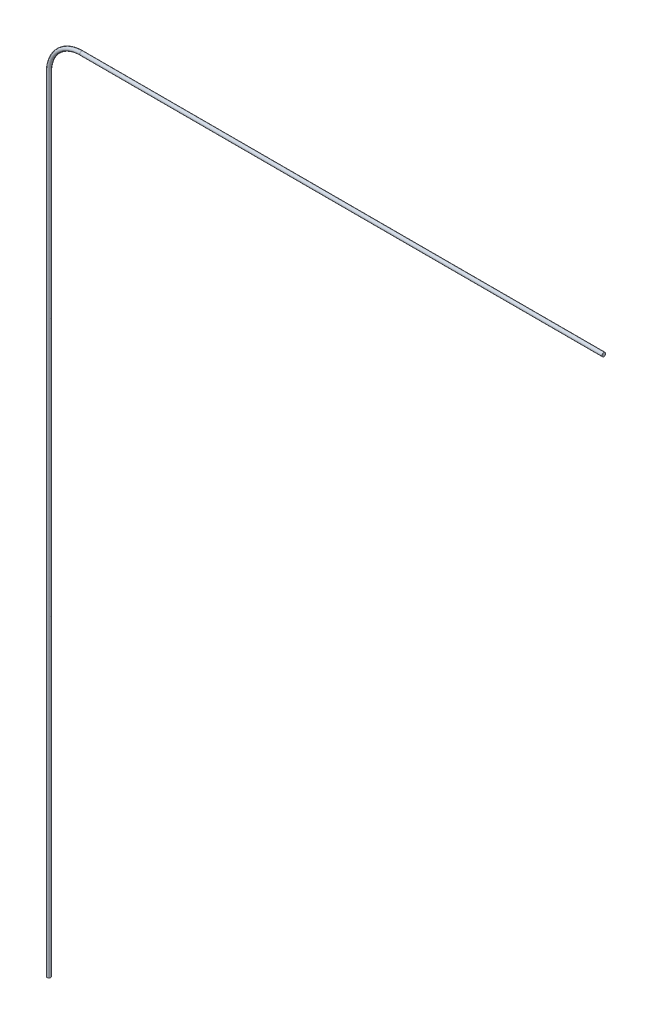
from build123d import *

# Parameters (mm, degrees)
SKETCH1_R = 0.179959


with BuildPart() as part:
    # Sweep1: sweep along a path in Sketch2
    with BuildLine(Plane.XY) as sweep1_path:
        Line((0, -76.2), (0, 0))
        ThreePointArc((0, 0), (0.92993597, 2.24506403), (3.175, 3.175))
        Line((3.175, 3.175), (53.975, 3.175))
    # Sketch1 → Sweep1 (sweep)
    with BuildSketch(Plane(origin=(0, 0, 0), x_dir=(1, 0, 0), z_dir=(0, 1, 0))):
        Circle(SKETCH1_R)
    sweep(path=sweep1_path.line)


solid = part.part
